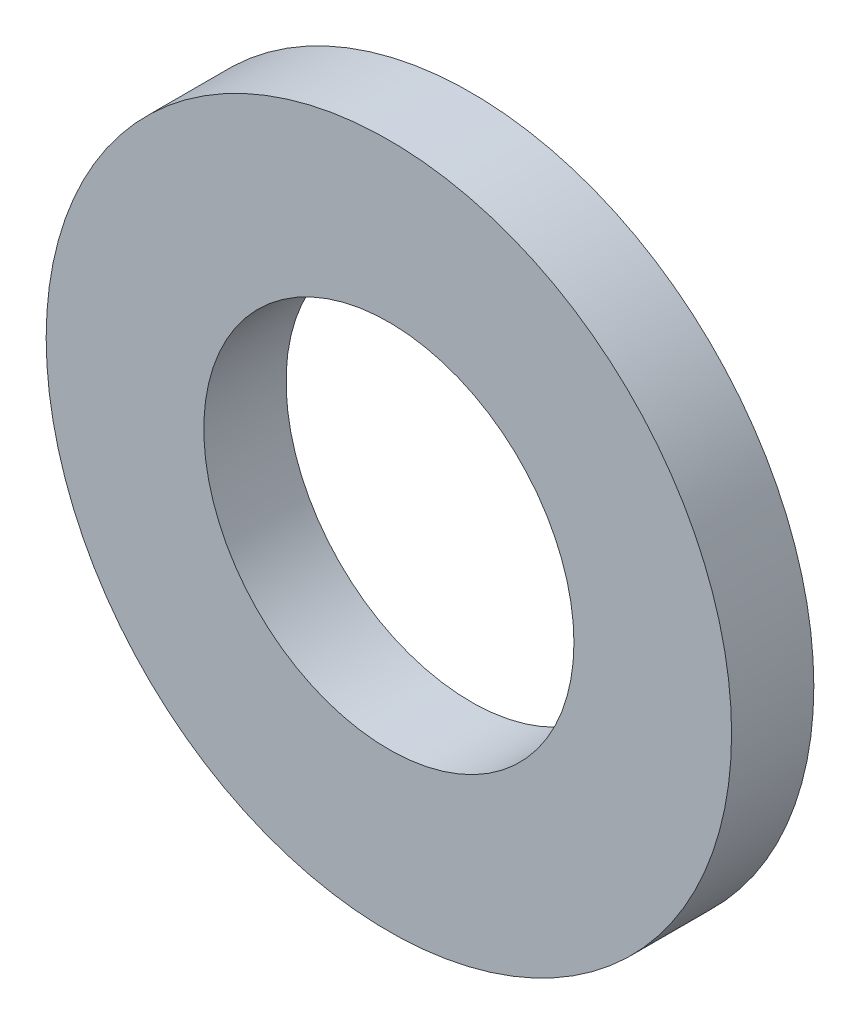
from build123d import *

# Parameters (mm, degrees)
ESQUISSE1_R          = 25
ESQUISSE1_R_2        = 13.5
BASE_EXTRUSION_DEPTH = 6


with BuildPart() as part:
    # Esquisse1 → Base-Extrusion (new body)
    with BuildSketch(Plane.XY):
        Circle(ESQUISSE1_R)
        Circle(ESQUISSE1_R_2, mode=Mode.SUBTRACT)
    extrude(amount=-BASE_EXTRUSION_DEPTH)


solid = part.part
